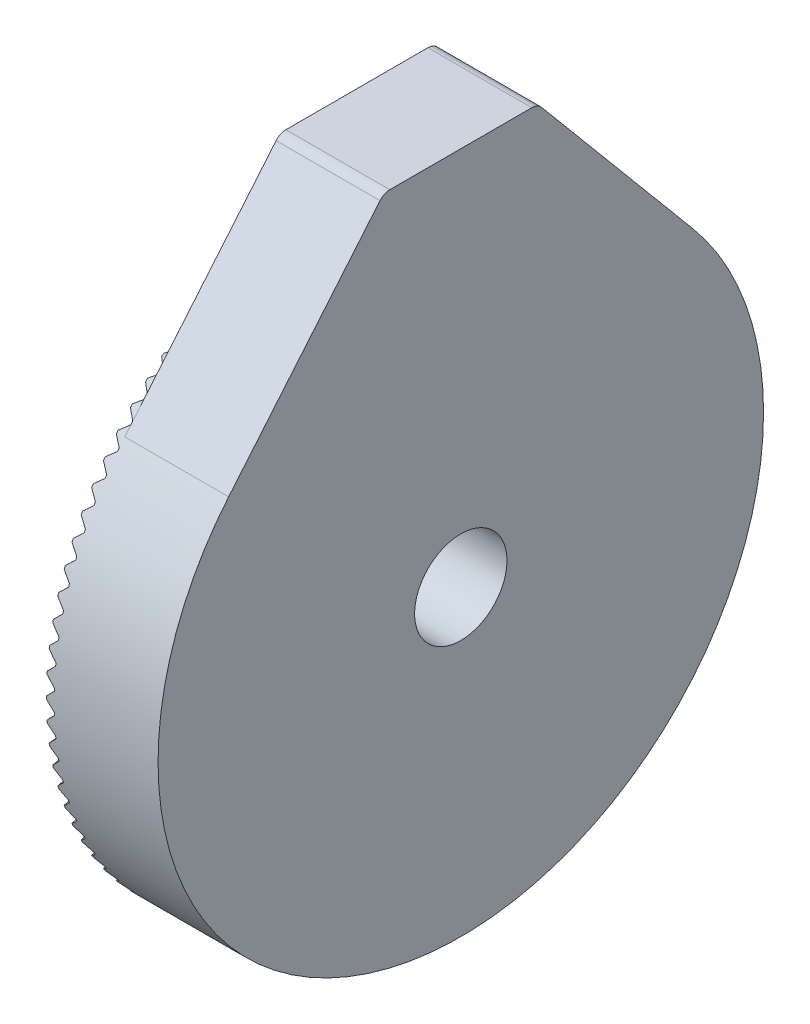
from build123d import *

# Parameters (mm, degrees)
BOSS_EXTRU_1_DEPTH           = 4.05
ENL_V_MAT_EXTRU_1_DEPTH      = 5
R_P_TITION_CIRCULAIRE2_COUNT = 90


with BuildPart() as part:
    # Esquisse2 → Base-R_volution (revolve)
    with BuildSketch(Plane.XY, mode=Mode.PRIVATE) as base_r_volution_sk:
        Polygon((-2.830443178, -1.8), (-6.580443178, -1.8), (-6.580443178, -3.5), (-9.93, -3.5), (-9.93, -5), (-4.330443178, -5), (-4.330443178, -10.3), (-7.128062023, -10.3), (-7.180443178, -11.8), (-2.830443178, -11.8), align=None)
    revolve(base_r_volution_sk.sketch.rotate(Axis((0, 0, 0), (-1, 0, 0)), 270), axis=Axis((0, 0, 0), (-1, 0, 0)))

    # Esquisse3 → Boss.-Extru.1 (add)
    with BuildSketch(Plane(origin=(-2.830443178, 0, 0), x_dir=(0, 0, -1), z_dir=(1, 0, 0))):
        with BuildLine():
            Line((-2.76647791, 14.8), (2.76647791, 14.8))
            ThreePointArc((2.76647791, 14.8), (2.978061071, 14.75302601), (3.149888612, 14.620930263))
            Line((3.149888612, 14.620930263), (9.04849256, 7.573954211))
            Line((9.04849256, 7.573954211), (7.27222233, 7.573954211))
            ThreePointArc((7.27222233, 7.573954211), (0, 10.5), (-7.27222233, 7.573954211))
            Line((-7.27222233, 7.573954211), (-9.04849256, 7.573954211))
            Line((-9.04849256, 7.573954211), (-3.149888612, 14.620930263))
            ThreePointArc((-3.149888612, 14.620930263), (-2.978061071, 14.75302601), (-2.76647791, 14.8))
        make_face()
    extrude(amount=-BOSS_EXTRU_1_DEPTH)

    # Esquisse10 → Enl_v. mat.-Extru.1 (cut)
    with BuildSketch(Plane(origin=(0, 11.8, 0), x_dir=(-1, 0, 0), z_dir=(0, 1, 0))):
        Polygon((7.682281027, 0.85683785), (7.682281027, -0.85683785), (6.880443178, -0.055), (6.880443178, 0.055), align=None)
    enl_v_mat_extru_1 = extrude(amount=-ENL_V_MAT_EXTRU_1_DEPTH, mode=Mode.SUBTRACT)

    # R_p_tition circulaire2: Enl_v. mat.-Extru.1 ×90 about axis
    r_p_tition_circulaire2_axis = Axis((0, 0, 0), (-1, 0, 0))
    for i in range(1, R_P_TITION_CIRCULAIRE2_COUNT):
        add(enl_v_mat_extru_1.rotate(r_p_tition_circulaire2_axis, i * 360 / R_P_TITION_CIRCULAIRE2_COUNT), mode=Mode.SUBTRACT)


solid = part.part
